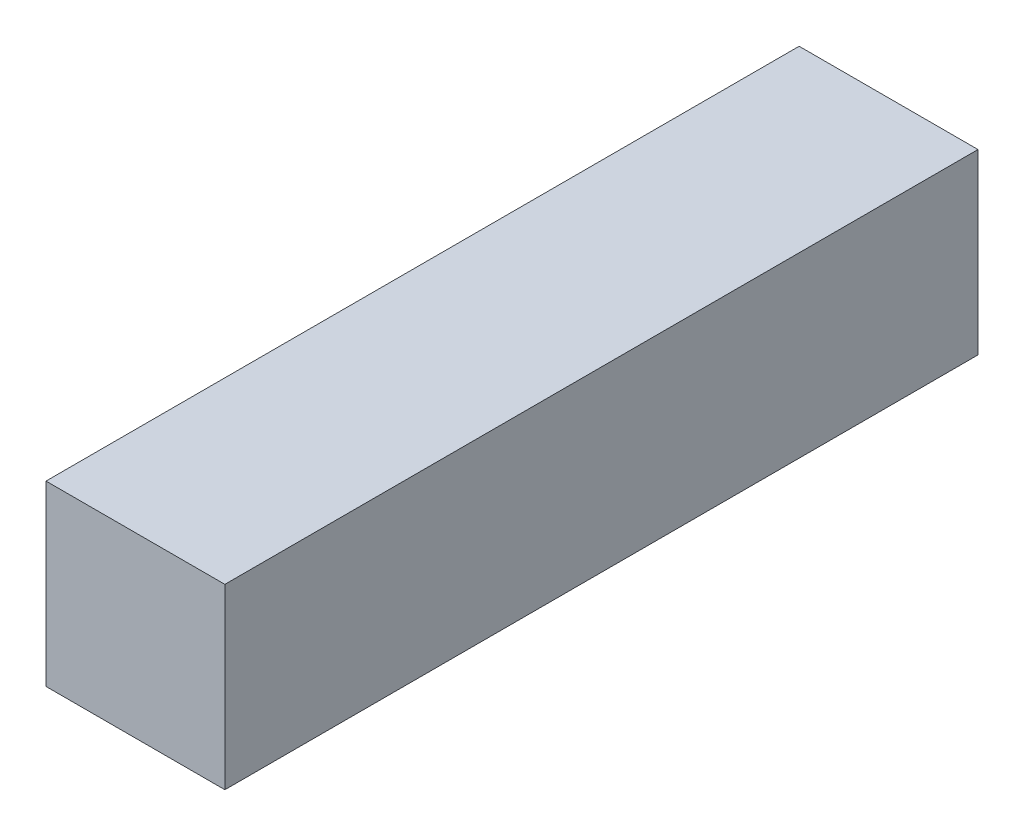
from build123d import *

# Parameters (mm, degrees)
SKETCH2_W           = 4.75
SKETCH2_H           = 4.724
BOSS_EXTRUDE1_DEPTH = 20


with BuildPart() as part:
    # Sketch2 → Boss-Extrude1 (new body)
    with BuildSketch(Plane.XY):
        with Locations((2.375, 2.362)):
            Rectangle(SKETCH2_W, SKETCH2_H)
    extrude(amount=BOSS_EXTRUDE1_DEPTH)


solid = part.part
